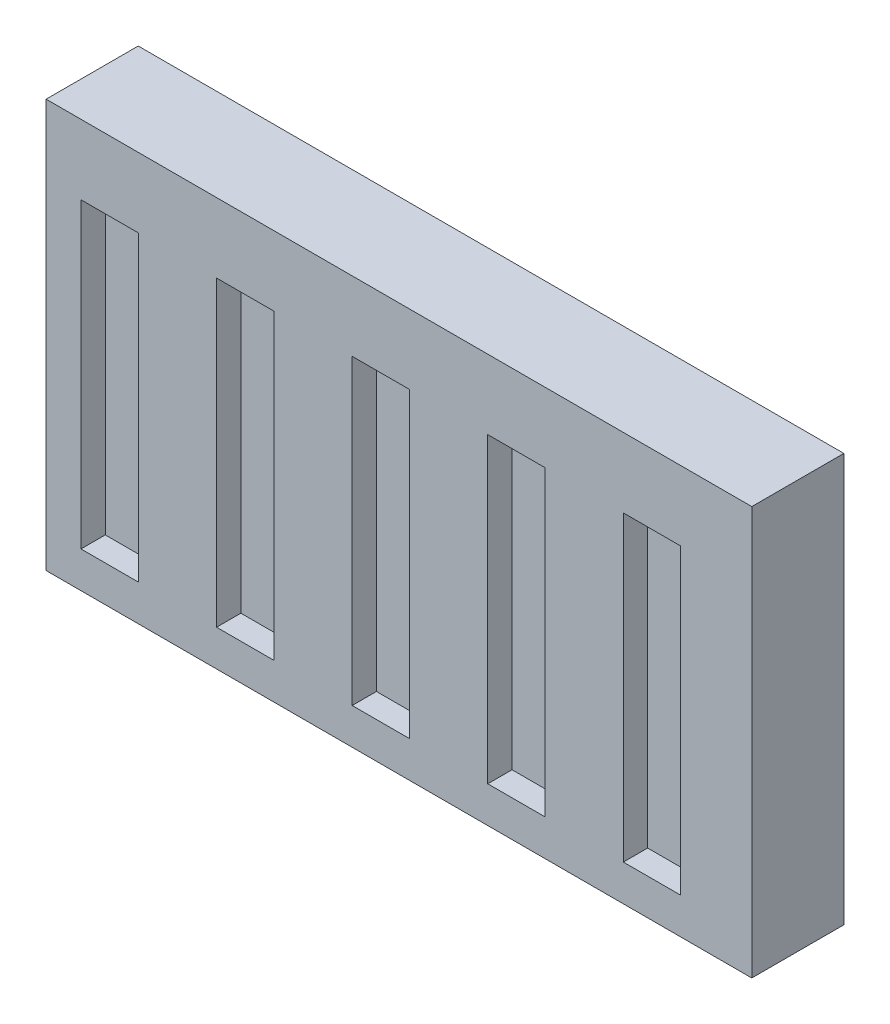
ISO-10303-21;
HEADER;
FILE_DESCRIPTION(('STEP AP214'),'2;1');
FILE_NAME('part.step','',(''),(''),'','','');
FILE_SCHEMA(('AUTOMOTIVE_DESIGN { 1 0 10303 214 1 1 1 1 }'));
ENDSEC;
DATA;
#1=APPLICATION_CONTEXT('core data for automotive mechanical design processes');
#2=APPLICATION_PROTOCOL_DEFINITION('international standard','automotive_design',2000,#1);
#3=PRODUCT_CONTEXT('',#1,'mechanical');
#4=PRODUCT('Part','Part','',(#3));
#5=PRODUCT_RELATED_PRODUCT_CATEGORY('part','',(#4));
#6=PRODUCT_DEFINITION_FORMATION('','',#4);
#7=PRODUCT_DEFINITION_CONTEXT('part definition',#1,'design');
#8=PRODUCT_DEFINITION('design','',#6,#7);
#9=PRODUCT_DEFINITION_SHAPE('','',#8);
#10=(LENGTH_UNIT() NAMED_UNIT(*) SI_UNIT(.MILLI.,.METRE.));
#11=(NAMED_UNIT(*) PLANE_ANGLE_UNIT() SI_UNIT($,.RADIAN.));
#12=(NAMED_UNIT(*) SI_UNIT($,.STERADIAN.) SOLID_ANGLE_UNIT());
#13=UNCERTAINTY_MEASURE_WITH_UNIT(LENGTH_MEASURE(1.E-05),#10,'distance_accuracy_value','');
#14=(GEOMETRIC_REPRESENTATION_CONTEXT(3) GLOBAL_UNCERTAINTY_ASSIGNED_CONTEXT((#13)) GLOBAL_UNIT_ASSIGNED_CONTEXT((#10,
#11,#12)) REPRESENTATION_CONTEXT('',''));
#15=CARTESIAN_POINT('',(0.,0.,0.));
#16=DIRECTION('',(0.,0.,1.));
#17=DIRECTION('',(1.,0.,0.));
#18=AXIS2_PLACEMENT_3D('',#15,#16,#17);
#19=CARTESIAN_POINT('',(0.,0.,16.3));
#20=DIRECTION('',(1.,0.,0.));
#21=DIRECTION('',(0.,0.,-1.));
#22=AXIS2_PLACEMENT_3D('',#19,#20,#21);
#23=PLANE('',#22);
#24=DIRECTION('',(0.,-1.,0.));
#25=VECTOR('',#24,1.);
#26=CARTESIAN_POINT('',(0.,0.,0.));
#27=LINE('',#26,#25);
#28=CARTESIAN_POINT('',(0.,72.2640495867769,0.));
#29=VERTEX_POINT('',#28);
#30=CARTESIAN_POINT('',(0.,0.,0.));
#31=VERTEX_POINT('',#30);
#32=EDGE_CURVE('E257',#29,#31,#27,.T.);
#33=ORIENTED_EDGE('',*,*,#32,.T.);
#34=DIRECTION('',(0.,0.,-1.));
#35=VECTOR('',#34,1.);
#36=CARTESIAN_POINT('',(0.,0.,16.3));
#37=LINE('',#36,#35);
#38=CARTESIAN_POINT('',(0.,0.,16.3));
#39=VERTEX_POINT('',#38);
#40=EDGE_CURVE('E290',#39,#31,#37,.T.);
#41=ORIENTED_EDGE('',*,*,#40,.F.);
#42=DIRECTION('',(0.,-1.,0.));
#43=VECTOR('',#42,1.);
#44=CARTESIAN_POINT('',(0.,0.,16.3));
#45=LINE('',#44,#43);
#46=CARTESIAN_POINT('',(0.,72.2640495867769,16.3));
#47=VERTEX_POINT('',#46);
#48=EDGE_CURVE('E272',#47,#39,#45,.T.);
#49=ORIENTED_EDGE('',*,*,#48,.F.);
#50=DIRECTION('',(0.,0.,-1.));
#51=VECTOR('',#50,1.);
#52=CARTESIAN_POINT('',(0.,72.2640495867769,16.3));
#53=LINE('',#52,#51);
#54=EDGE_CURVE('E281',#47,#29,#53,.T.);
#55=ORIENTED_EDGE('',*,*,#54,.T.);
#56=EDGE_LOOP('',(#33,#41,#49,#55));
#57=FACE_BOUND('',#56,.T.);
#58=ADVANCED_FACE('F28',(#57),#23,.F.);
#59=CARTESIAN_POINT('',(0.,0.,16.3));
#60=DIRECTION('',(0.,1.,0.));
#61=DIRECTION('',(0.,0.,1.));
#62=AXIS2_PLACEMENT_3D('',#59,#60,#61);
#63=PLANE('',#62);
#64=DIRECTION('',(1.,0.,0.));
#65=VECTOR('',#64,1.);
#66=CARTESIAN_POINT('',(0.,0.,0.));
#67=LINE('',#66,#65);
#68=CARTESIAN_POINT('',(124.900826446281,0.,0.));
#69=VERTEX_POINT('',#68);
#70=EDGE_CURVE('E266',#31,#69,#67,.T.);
#71=ORIENTED_EDGE('',*,*,#70,.T.);
#72=DIRECTION('',(0.,0.,-1.));
#73=VECTOR('',#72,1.);
#74=CARTESIAN_POINT('',(124.900826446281,0.,16.3));
#75=LINE('',#74,#73);
#76=CARTESIAN_POINT('',(124.900826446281,0.,16.3));
#77=VERTEX_POINT('',#76);
#78=EDGE_CURVE('E287',#77,#69,#75,.T.);
#79=ORIENTED_EDGE('',*,*,#78,.F.);
#80=DIRECTION('',(1.,0.,0.));
#81=VECTOR('',#80,1.);
#82=CARTESIAN_POINT('',(0.,0.,16.3));
#83=LINE('',#82,#81);
#84=EDGE_CURVE('E275',#39,#77,#83,.T.);
#85=ORIENTED_EDGE('',*,*,#84,.F.);
#86=ORIENTED_EDGE('',*,*,#40,.T.);
#87=EDGE_LOOP('',(#71,#79,#85,#86));
#88=FACE_BOUND('',#87,.T.);
#89=ADVANCED_FACE('F416',(#88),#63,.F.);
#90=CARTESIAN_POINT('',(124.900826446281,0.,16.3));
#91=DIRECTION('',(-1.,0.,0.));
#92=DIRECTION('',(0.,0.,1.));
#93=AXIS2_PLACEMENT_3D('',#90,#91,#92);
#94=PLANE('',#93);
#95=DIRECTION('',(0.,1.,0.));
#96=VECTOR('',#95,1.);
#97=CARTESIAN_POINT('',(124.900826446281,0.,0.));
#98=LINE('',#97,#96);
#99=CARTESIAN_POINT('',(124.900826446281,72.2640495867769,0.));
#100=VERTEX_POINT('',#99);
#101=EDGE_CURVE('E268',#69,#100,#98,.T.);
#102=ORIENTED_EDGE('',*,*,#101,.T.);
#103=DIRECTION('',(0.,0.,-1.));
#104=VECTOR('',#103,1.);
#105=CARTESIAN_POINT('',(124.900826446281,72.2640495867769,16.3));
#106=LINE('',#105,#104);
#107=CARTESIAN_POINT('',(124.900826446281,72.2640495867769,16.3));
#108=VERTEX_POINT('',#107);
#109=EDGE_CURVE('E284',#108,#100,#106,.T.);
#110=ORIENTED_EDGE('',*,*,#109,.F.);
#111=DIRECTION('',(0.,1.,0.));
#112=VECTOR('',#111,1.);
#113=CARTESIAN_POINT('',(124.900826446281,0.,16.3));
#114=LINE('',#113,#112);
#115=EDGE_CURVE('E277',#77,#108,#114,.T.);
#116=ORIENTED_EDGE('',*,*,#115,.F.);
#117=ORIENTED_EDGE('',*,*,#78,.T.);
#118=EDGE_LOOP('',(#102,#110,#116,#117));
#119=FACE_BOUND('',#118,.T.);
#120=ADVANCED_FACE('F411',(#119),#94,.F.);
#121=CARTESIAN_POINT('',(0.,72.2640495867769,16.3));
#122=DIRECTION('',(0.,-1.,0.));
#123=DIRECTION('',(0.,0.,-1.));
#124=AXIS2_PLACEMENT_3D('',#121,#122,#123);
#125=PLANE('',#124);
#126=DIRECTION('',(-1.,0.,0.));
#127=VECTOR('',#126,1.);
#128=CARTESIAN_POINT('',(0.,72.2640495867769,0.));
#129=LINE('',#128,#127);
#130=EDGE_CURVE('E270',#100,#29,#129,.T.);
#131=ORIENTED_EDGE('',*,*,#130,.T.);
#132=ORIENTED_EDGE('',*,*,#54,.F.);
#133=DIRECTION('',(-1.,0.,0.));
#134=VECTOR('',#133,1.);
#135=CARTESIAN_POINT('',(0.,72.2640495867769,16.3));
#136=LINE('',#135,#134);
#137=EDGE_CURVE('E279',#108,#47,#136,.T.);
#138=ORIENTED_EDGE('',*,*,#137,.F.);
#139=ORIENTED_EDGE('',*,*,#109,.T.);
#140=EDGE_LOOP('',(#131,#132,#138,#139));
#141=FACE_BOUND('',#140,.T.);
#142=ADVANCED_FACE('F399',(#141),#125,.F.);
#143=CARTESIAN_POINT('',(0.,72.2640495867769,16.3));
#144=DIRECTION('',(0.,0.,-1.));
#145=DIRECTION('',(-1.,0.,0.));
#146=AXIS2_PLACEMENT_3D('',#143,#144,#145);
#147=PLANE('',#146);
#148=DIRECTION('',(1.,0.,0.));
#149=VECTOR('',#148,1.);
#150=CARTESIAN_POINT('',(30.1669795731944,6.40222008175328,16.3));
#151=LINE('',#150,#149);
#152=CARTESIAN_POINT('',(30.1669795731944,6.40222008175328,16.3));
#153=VERTEX_POINT('',#152);
#154=CARTESIAN_POINT('',(40.3277941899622,6.40222008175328,16.3));
#155=VERTEX_POINT('',#154);
#156=EDGE_CURVE('E202',#153,#155,#151,.T.);
#157=ORIENTED_EDGE('',*,*,#156,.F.);
#158=DIRECTION('',(0.,-1.,0.));
#159=VECTOR('',#158,1.);
#160=CARTESIAN_POINT('',(30.1669795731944,6.40222008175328,16.3));
#161=LINE('',#160,#159);
#162=CARTESIAN_POINT('',(30.1669795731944,59.9292769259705,16.3));
#163=VERTEX_POINT('',#162);
#164=EDGE_CURVE('E216',#163,#153,#161,.T.);
#165=ORIENTED_EDGE('',*,*,#164,.F.);
#166=DIRECTION('',(-1.,0.,0.));
#167=VECTOR('',#166,1.);
#168=CARTESIAN_POINT('',(30.1669795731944,59.9292769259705,16.3));
#169=LINE('',#168,#167);
#170=CARTESIAN_POINT('',(40.3277941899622,59.9292769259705,16.3));
#171=VERTEX_POINT('',#170);
#172=EDGE_CURVE('E226',#171,#163,#169,.T.);
#173=ORIENTED_EDGE('',*,*,#172,.F.);
#174=DIRECTION('',(0.,1.,0.));
#175=VECTOR('',#174,1.);
#176=CARTESIAN_POINT('',(40.3277941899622,6.40222008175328,16.3));
#177=LINE('',#176,#175);
#178=EDGE_CURVE('E217',#155,#171,#177,.T.);
#179=ORIENTED_EDGE('',*,*,#178,.F.);
#180=EDGE_LOOP('',(#157,#165,#173,#179));
#181=FACE_BOUND('',#180,.T.);
#182=DIRECTION('',(1.,0.,0.));
#183=VECTOR('',#182,1.);
#184=CARTESIAN_POINT('',(6.16697957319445,6.40222008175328,16.3));
#185=LINE('',#184,#183);
#186=CARTESIAN_POINT('',(6.16697957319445,6.40222008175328,16.3));
#187=VERTEX_POINT('',#186);
#188=CARTESIAN_POINT('',(16.3277941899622,6.40222008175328,16.3));
#189=VERTEX_POINT('',#188);
#190=EDGE_CURVE('E233',#187,#189,#185,.T.);
#191=ORIENTED_EDGE('',*,*,#190,.F.);
#192=DIRECTION('',(0.,-1.,0.));
#193=VECTOR('',#192,1.);
#194=CARTESIAN_POINT('',(6.16697957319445,6.40222008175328,16.3));
#195=LINE('',#194,#193);
#196=CARTESIAN_POINT('',(6.16697957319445,59.9292769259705,16.3));
#197=VERTEX_POINT('',#196);
#198=EDGE_CURVE('E231',#197,#187,#195,.T.);
#199=ORIENTED_EDGE('',*,*,#198,.F.);
#200=DIRECTION('',(-1.,0.,0.));
#201=VECTOR('',#200,1.);
#202=CARTESIAN_POINT('',(6.16697957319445,59.9292769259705,16.3));
#203=LINE('',#202,#201);
#204=CARTESIAN_POINT('',(16.3277941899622,59.9292769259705,16.3));
#205=VERTEX_POINT('',#204);
#206=EDGE_CURVE('E239',#205,#197,#203,.T.);
#207=ORIENTED_EDGE('',*,*,#206,.F.);
#208=DIRECTION('',(0.,1.,0.));
#209=VECTOR('',#208,1.);
#210=CARTESIAN_POINT('',(16.3277941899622,6.40222008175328,16.3));
#211=LINE('',#210,#209);
#212=EDGE_CURVE('E236',#189,#205,#211,.T.);
#213=ORIENTED_EDGE('',*,*,#212,.F.);
#214=EDGE_LOOP('',(#191,#199,#207,#213));
#215=FACE_BOUND('',#214,.T.);
#216=ORIENTED_EDGE('',*,*,#48,.T.);
#217=ORIENTED_EDGE('',*,*,#84,.T.);
#218=ORIENTED_EDGE('',*,*,#115,.T.);
#219=ORIENTED_EDGE('',*,*,#137,.T.);
#220=EDGE_LOOP('',(#216,#217,#218,#219));
#221=FACE_BOUND('',#220,.T.);
#222=DIRECTION('',(0.,-1.,0.));
#223=VECTOR('',#222,1.);
#224=CARTESIAN_POINT('',(54.1669795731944,6.40222008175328,16.3));
#225=LINE('',#224,#223);
#226=CARTESIAN_POINT('',(54.1669795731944,59.9292769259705,16.3));
#227=VERTEX_POINT('',#226);
#228=CARTESIAN_POINT('',(54.1669795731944,6.40222008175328,16.3));
#229=VERTEX_POINT('',#228);
#230=EDGE_CURVE('E293',#227,#229,#225,.T.);
#231=ORIENTED_EDGE('',*,*,#230,.F.);
#232=DIRECTION('',(-1.,0.,0.));
#233=VECTOR('',#232,1.);
#234=CARTESIAN_POINT('',(54.1669795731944,59.9292769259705,16.3));
#235=LINE('',#234,#233);
#236=CARTESIAN_POINT('',(64.3277941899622,59.9292769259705,16.3));
#237=VERTEX_POINT('',#236);
#238=EDGE_CURVE('E295',#237,#227,#235,.T.);
#239=ORIENTED_EDGE('',*,*,#238,.F.);
#240=DIRECTION('',(0.,1.,0.));
#241=VECTOR('',#240,1.);
#242=CARTESIAN_POINT('',(64.3277941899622,6.40222008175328,16.3));
#243=LINE('',#242,#241);
#244=CARTESIAN_POINT('',(64.3277941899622,6.40222008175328,16.3));
#245=VERTEX_POINT('',#244);
#246=EDGE_CURVE('E298',#245,#237,#243,.T.);
#247=ORIENTED_EDGE('',*,*,#246,.F.);
#248=DIRECTION('',(1.,0.,0.));
#249=VECTOR('',#248,1.);
#250=CARTESIAN_POINT('',(54.1669795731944,6.40222008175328,16.3));
#251=LINE('',#250,#249);
#252=EDGE_CURVE('E301',#229,#245,#251,.T.);
#253=ORIENTED_EDGE('',*,*,#252,.F.);
#254=EDGE_LOOP('',(#231,#239,#247,#253));
#255=FACE_BOUND('',#254,.T.);
#256=DIRECTION('',(0.,-1.,0.));
#257=VECTOR('',#256,1.);
#258=CARTESIAN_POINT('',(78.1669795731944,6.40222008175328,16.3));
#259=LINE('',#258,#257);
#260=CARTESIAN_POINT('',(78.1669795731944,59.9292769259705,16.3));
#261=VERTEX_POINT('',#260);
#262=CARTESIAN_POINT('',(78.1669795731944,6.40222008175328,16.3));
#263=VERTEX_POINT('',#262);
#264=EDGE_CURVE('E328',#261,#263,#259,.T.);
#265=ORIENTED_EDGE('',*,*,#264,.F.);
#266=DIRECTION('',(-1.,0.,0.));
#267=VECTOR('',#266,1.);
#268=CARTESIAN_POINT('',(78.1669795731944,59.9292769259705,16.3));
#269=LINE('',#268,#267);
#270=CARTESIAN_POINT('',(88.3277941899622,59.9292769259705,16.3));
#271=VERTEX_POINT('',#270);
#272=EDGE_CURVE('E330',#271,#261,#269,.T.);
#273=ORIENTED_EDGE('',*,*,#272,.F.);
#274=DIRECTION('',(0.,1.,0.));
#275=VECTOR('',#274,1.);
#276=CARTESIAN_POINT('',(88.3277941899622,6.40222008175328,16.3));
#277=LINE('',#276,#275);
#278=CARTESIAN_POINT('',(88.3277941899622,6.40222008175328,16.3));
#279=VERTEX_POINT('',#278);
#280=EDGE_CURVE('E333',#279,#271,#277,.T.);
#281=ORIENTED_EDGE('',*,*,#280,.F.);
#282=DIRECTION('',(1.,0.,0.));
#283=VECTOR('',#282,1.);
#284=CARTESIAN_POINT('',(78.1669795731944,6.40222008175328,16.3));
#285=LINE('',#284,#283);
#286=EDGE_CURVE('E336',#263,#279,#285,.T.);
#287=ORIENTED_EDGE('',*,*,#286,.F.);
#288=EDGE_LOOP('',(#265,#273,#281,#287));
#289=FACE_BOUND('',#288,.T.);
#290=DIRECTION('',(0.,-1.,0.));
#291=VECTOR('',#290,1.);
#292=CARTESIAN_POINT('',(102.166979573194,6.40222008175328,16.3));
#293=LINE('',#292,#291);
#294=CARTESIAN_POINT('',(102.166979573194,59.9292769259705,16.3));
#295=VERTEX_POINT('',#294);
#296=CARTESIAN_POINT('',(102.166979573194,6.40222008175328,16.3));
#297=VERTEX_POINT('',#296);
#298=EDGE_CURVE('E363',#295,#297,#293,.T.);
#299=ORIENTED_EDGE('',*,*,#298,.F.);
#300=DIRECTION('',(-1.,0.,0.));
#301=VECTOR('',#300,1.);
#302=CARTESIAN_POINT('',(102.166979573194,59.9292769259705,16.3));
#303=LINE('',#302,#301);
#304=CARTESIAN_POINT('',(112.327794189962,59.9292769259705,16.3));
#305=VERTEX_POINT('',#304);
#306=EDGE_CURVE('E365',#305,#295,#303,.T.);
#307=ORIENTED_EDGE('',*,*,#306,.F.);
#308=DIRECTION('',(0.,1.,0.));
#309=VECTOR('',#308,1.);
#310=CARTESIAN_POINT('',(112.327794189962,6.40222008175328,16.3));
#311=LINE('',#310,#309);
#312=CARTESIAN_POINT('',(112.327794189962,6.40222008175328,16.3));
#313=VERTEX_POINT('',#312);
#314=EDGE_CURVE('E368',#313,#305,#311,.T.);
#315=ORIENTED_EDGE('',*,*,#314,.F.);
#316=DIRECTION('',(1.,0.,0.));
#317=VECTOR('',#316,1.);
#318=CARTESIAN_POINT('',(102.166979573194,6.40222008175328,16.3));
#319=LINE('',#318,#317);
#320=EDGE_CURVE('E371',#297,#313,#319,.T.);
#321=ORIENTED_EDGE('',*,*,#320,.F.);
#322=EDGE_LOOP('',(#299,#307,#315,#321));
#323=FACE_BOUND('',#322,.T.);
#324=ADVANCED_FACE('F396',(#181,#215,#221,#255,#289,#323),#147,.F.);
#325=CARTESIAN_POINT('',(0.,72.2640495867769,0.));
#326=DIRECTION('',(0.,0.,-1.));
#327=DIRECTION('',(-1.,0.,0.));
#328=AXIS2_PLACEMENT_3D('',#325,#326,#327);
#329=PLANE('',#328);
#330=ORIENTED_EDGE('',*,*,#32,.F.);
#331=ORIENTED_EDGE('',*,*,#130,.F.);
#332=ORIENTED_EDGE('',*,*,#101,.F.);
#333=ORIENTED_EDGE('',*,*,#70,.F.);
#334=EDGE_LOOP('',(#330,#331,#332,#333));
#335=FACE_BOUND('',#334,.T.);
#336=ADVANCED_FACE('F398',(#335),#329,.T.);
#337=CARTESIAN_POINT('',(6.16697957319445,6.40222008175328,12.));
#338=DIRECTION('',(-1.,0.,0.));
#339=DIRECTION('',(0.,0.,1.));
#340=AXIS2_PLACEMENT_3D('',#337,#338,#339);
#341=PLANE('',#340);
#342=ORIENTED_EDGE('',*,*,#198,.T.);
#343=DIRECTION('',(0.,0.,1.));
#344=VECTOR('',#343,1.);
#345=CARTESIAN_POINT('',(6.16697957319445,6.40222008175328,12.));
#346=LINE('',#345,#344);
#347=CARTESIAN_POINT('',(6.16697957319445,6.40222008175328,12.));
#348=VERTEX_POINT('',#347);
#349=EDGE_CURVE('E254',#348,#187,#346,.T.);
#350=ORIENTED_EDGE('',*,*,#349,.F.);
#351=DIRECTION('',(0.,-1.,0.));
#352=VECTOR('',#351,1.);
#353=CARTESIAN_POINT('',(6.16697957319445,6.40222008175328,12.));
#354=LINE('',#353,#352);
#355=CARTESIAN_POINT('',(6.16697957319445,59.9292769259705,12.));
#356=VERTEX_POINT('',#355);
#357=EDGE_CURVE('E242',#356,#348,#354,.T.);
#358=ORIENTED_EDGE('',*,*,#357,.F.);
#359=DIRECTION('',(0.,0.,1.));
#360=VECTOR('',#359,1.);
#361=CARTESIAN_POINT('',(6.16697957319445,59.9292769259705,12.));
#362=LINE('',#361,#360);
#363=EDGE_CURVE('E255',#356,#197,#362,.T.);
#364=ORIENTED_EDGE('',*,*,#363,.T.);
#365=EDGE_LOOP('',(#342,#350,#358,#364));
#366=FACE_BOUND('',#365,.T.);
#367=ADVANCED_FACE('F407',(#366),#341,.F.);
#368=CARTESIAN_POINT('',(6.16697957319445,59.9292769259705,12.));
#369=DIRECTION('',(0.,1.,0.));
#370=DIRECTION('',(0.,0.,1.));
#371=AXIS2_PLACEMENT_3D('',#368,#369,#370);
#372=PLANE('',#371);
#373=ORIENTED_EDGE('',*,*,#206,.T.);
#374=ORIENTED_EDGE('',*,*,#363,.F.);
#375=DIRECTION('',(-1.,0.,0.));
#376=VECTOR('',#375,1.);
#377=CARTESIAN_POINT('',(6.16697957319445,59.9292769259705,12.));
#378=LINE('',#377,#376);
#379=CARTESIAN_POINT('',(16.3277941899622,59.9292769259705,12.));
#380=VERTEX_POINT('',#379);
#381=EDGE_CURVE('E251',#380,#356,#378,.T.);
#382=ORIENTED_EDGE('',*,*,#381,.F.);
#383=DIRECTION('',(0.,0.,1.));
#384=VECTOR('',#383,1.);
#385=CARTESIAN_POINT('',(16.3277941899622,59.9292769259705,12.));
#386=LINE('',#385,#384);
#387=EDGE_CURVE('E258',#380,#205,#386,.T.);
#388=ORIENTED_EDGE('',*,*,#387,.T.);
#389=EDGE_LOOP('',(#373,#374,#382,#388));
#390=FACE_BOUND('',#389,.T.);
#391=ADVANCED_FACE('F573',(#390),#372,.F.);
#392=CARTESIAN_POINT('',(16.3277941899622,6.40222008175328,12.));
#393=DIRECTION('',(1.,0.,0.));
#394=DIRECTION('',(0.,0.,-1.));
#395=AXIS2_PLACEMENT_3D('',#392,#393,#394);
#396=PLANE('',#395);
#397=ORIENTED_EDGE('',*,*,#212,.T.);
#398=ORIENTED_EDGE('',*,*,#387,.F.);
#399=DIRECTION('',(0.,1.,0.));
#400=VECTOR('',#399,1.);
#401=CARTESIAN_POINT('',(16.3277941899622,6.40222008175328,12.));
#402=LINE('',#401,#400);
#403=CARTESIAN_POINT('',(16.3277941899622,6.40222008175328,12.));
#404=VERTEX_POINT('',#403);
#405=EDGE_CURVE('E248',#404,#380,#402,.T.);
#406=ORIENTED_EDGE('',*,*,#405,.F.);
#407=DIRECTION('',(0.,0.,1.));
#408=VECTOR('',#407,1.);
#409=CARTESIAN_POINT('',(16.3277941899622,6.40222008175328,12.));
#410=LINE('',#409,#408);
#411=EDGE_CURVE('E260',#404,#189,#410,.T.);
#412=ORIENTED_EDGE('',*,*,#411,.T.);
#413=EDGE_LOOP('',(#397,#398,#406,#412));
#414=FACE_BOUND('',#413,.T.);
#415=ADVANCED_FACE('F565',(#414),#396,.F.);
#416=CARTESIAN_POINT('',(6.16697957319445,6.40222008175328,12.));
#417=DIRECTION('',(0.,-1.,0.));
#418=DIRECTION('',(0.,0.,-1.));
#419=AXIS2_PLACEMENT_3D('',#416,#417,#418);
#420=PLANE('',#419);
#421=ORIENTED_EDGE('',*,*,#190,.T.);
#422=ORIENTED_EDGE('',*,*,#411,.F.);
#423=DIRECTION('',(1.,0.,0.));
#424=VECTOR('',#423,1.);
#425=CARTESIAN_POINT('',(6.16697957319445,6.40222008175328,12.));
#426=LINE('',#425,#424);
#427=EDGE_CURVE('E245',#348,#404,#426,.T.);
#428=ORIENTED_EDGE('',*,*,#427,.F.);
#429=ORIENTED_EDGE('',*,*,#349,.T.);
#430=EDGE_LOOP('',(#421,#422,#428,#429));
#431=FACE_BOUND('',#430,.T.);
#432=ADVANCED_FACE('F557',(#431),#420,.F.);
#433=CARTESIAN_POINT('',(6.16697957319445,59.9292769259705,12.));
#434=DIRECTION('',(0.,0.,-1.));
#435=DIRECTION('',(-1.,0.,0.));
#436=AXIS2_PLACEMENT_3D('',#433,#434,#435);
#437=PLANE('',#436);
#438=ORIENTED_EDGE('',*,*,#357,.T.);
#439=ORIENTED_EDGE('',*,*,#427,.T.);
#440=ORIENTED_EDGE('',*,*,#405,.T.);
#441=ORIENTED_EDGE('',*,*,#381,.T.);
#442=EDGE_LOOP('',(#438,#439,#440,#441));
#443=FACE_BOUND('',#442,.T.);
#444=ADVANCED_FACE('F524',(#443),#437,.F.);
#445=CARTESIAN_POINT('',(30.1669795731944,6.40222008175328,12.));
#446=DIRECTION('',(-1.,0.,0.));
#447=DIRECTION('',(0.,0.,1.));
#448=AXIS2_PLACEMENT_3D('',#445,#446,#447);
#449=PLANE('',#448);
#450=ORIENTED_EDGE('',*,*,#164,.T.);
#451=DIRECTION('',(0.,0.,1.));
#452=VECTOR('',#451,1.);
#453=CARTESIAN_POINT('',(30.1669795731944,6.40222008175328,12.));
#454=LINE('',#453,#452);
#455=CARTESIAN_POINT('',(30.1669795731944,6.40222008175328,12.));
#456=VERTEX_POINT('',#455);
#457=EDGE_CURVE('E208',#456,#153,#454,.T.);
#458=ORIENTED_EDGE('',*,*,#457,.F.);
#459=DIRECTION('',(0.,-1.,0.));
#460=VECTOR('',#459,1.);
#461=CARTESIAN_POINT('',(30.1669795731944,6.40222008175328,12.));
#462=LINE('',#461,#460);
#463=CARTESIAN_POINT('',(30.1669795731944,59.9292769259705,12.));
#464=VERTEX_POINT('',#463);
#465=EDGE_CURVE('E191',#464,#456,#462,.T.);
#466=ORIENTED_EDGE('',*,*,#465,.F.);
#467=DIRECTION('',(0.,0.,1.));
#468=VECTOR('',#467,1.);
#469=CARTESIAN_POINT('',(30.1669795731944,59.9292769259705,12.));
#470=LINE('',#469,#468);
#471=EDGE_CURVE('E228',#464,#163,#470,.T.);
#472=ORIENTED_EDGE('',*,*,#471,.T.);
#473=EDGE_LOOP('',(#450,#458,#466,#472));
#474=FACE_BOUND('',#473,.T.);
#475=ADVANCED_FACE('F214',(#474),#449,.F.);
#476=CARTESIAN_POINT('',(30.1669795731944,59.9292769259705,12.));
#477=DIRECTION('',(0.,1.,0.));
#478=DIRECTION('',(0.,0.,1.));
#479=AXIS2_PLACEMENT_3D('',#476,#477,#478);
#480=PLANE('',#479);
#481=ORIENTED_EDGE('',*,*,#172,.T.);
#482=ORIENTED_EDGE('',*,*,#471,.F.);
#483=DIRECTION('',(-1.,0.,0.));
#484=VECTOR('',#483,1.);
#485=CARTESIAN_POINT('',(30.1669795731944,59.9292769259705,12.));
#486=LINE('',#485,#484);
#487=CARTESIAN_POINT('',(40.3277941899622,59.9292769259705,12.));
#488=VERTEX_POINT('',#487);
#489=EDGE_CURVE('E197',#488,#464,#486,.T.);
#490=ORIENTED_EDGE('',*,*,#489,.F.);
#491=DIRECTION('',(0.,0.,1.));
#492=VECTOR('',#491,1.);
#493=CARTESIAN_POINT('',(40.3277941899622,59.9292769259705,12.));
#494=LINE('',#493,#492);
#495=EDGE_CURVE('E219',#488,#171,#494,.T.);
#496=ORIENTED_EDGE('',*,*,#495,.T.);
#497=EDGE_LOOP('',(#481,#482,#490,#496));
#498=FACE_BOUND('',#497,.T.);
#499=ADVANCED_FACE('F537',(#498),#480,.F.);
#500=CARTESIAN_POINT('',(40.3277941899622,6.40222008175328,12.));
#501=DIRECTION('',(1.,0.,0.));
#502=DIRECTION('',(0.,0.,-1.));
#503=AXIS2_PLACEMENT_3D('',#500,#501,#502);
#504=PLANE('',#503);
#505=ORIENTED_EDGE('',*,*,#178,.T.);
#506=ORIENTED_EDGE('',*,*,#495,.F.);
#507=DIRECTION('',(0.,1.,0.));
#508=VECTOR('',#507,1.);
#509=CARTESIAN_POINT('',(40.3277941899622,6.40222008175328,12.));
#510=LINE('',#509,#508);
#511=CARTESIAN_POINT('',(40.3277941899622,6.40222008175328,12.));
#512=VERTEX_POINT('',#511);
#513=EDGE_CURVE('E212',#512,#488,#510,.T.);
#514=ORIENTED_EDGE('',*,*,#513,.F.);
#515=DIRECTION('',(0.,0.,1.));
#516=VECTOR('',#515,1.);
#517=CARTESIAN_POINT('',(40.3277941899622,6.40222008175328,12.));
#518=LINE('',#517,#516);
#519=EDGE_CURVE('E211',#512,#155,#518,.T.);
#520=ORIENTED_EDGE('',*,*,#519,.T.);
#521=EDGE_LOOP('',(#505,#506,#514,#520));
#522=FACE_BOUND('',#521,.T.);
#523=ADVANCED_FACE('F530',(#522),#504,.F.);
#524=CARTESIAN_POINT('',(30.1669795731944,6.40222008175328,12.));
#525=DIRECTION('',(0.,-1.,0.));
#526=DIRECTION('',(0.,0.,-1.));
#527=AXIS2_PLACEMENT_3D('',#524,#525,#526);
#528=PLANE('',#527);
#529=ORIENTED_EDGE('',*,*,#156,.T.);
#530=ORIENTED_EDGE('',*,*,#519,.F.);
#531=DIRECTION('',(1.,0.,0.));
#532=VECTOR('',#531,1.);
#533=CARTESIAN_POINT('',(30.1669795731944,6.40222008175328,12.));
#534=LINE('',#533,#532);
#535=EDGE_CURVE('E194',#456,#512,#534,.T.);
#536=ORIENTED_EDGE('',*,*,#535,.F.);
#537=ORIENTED_EDGE('',*,*,#457,.T.);
#538=EDGE_LOOP('',(#529,#530,#536,#537));
#539=FACE_BOUND('',#538,.T.);
#540=ADVANCED_FACE('F207',(#539),#528,.F.);
#541=CARTESIAN_POINT('',(30.1669795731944,59.9292769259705,12.));
#542=DIRECTION('',(0.,0.,-1.));
#543=DIRECTION('',(-1.,0.,0.));
#544=AXIS2_PLACEMENT_3D('',#541,#542,#543);
#545=PLANE('',#544);
#546=ORIENTED_EDGE('',*,*,#465,.T.);
#547=ORIENTED_EDGE('',*,*,#535,.T.);
#548=ORIENTED_EDGE('',*,*,#513,.T.);
#549=ORIENTED_EDGE('',*,*,#489,.T.);
#550=EDGE_LOOP('',(#546,#547,#548,#549));
#551=FACE_BOUND('',#550,.T.);
#552=ADVANCED_FACE('F193',(#551),#545,.F.);
#553=CARTESIAN_POINT('',(54.1669795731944,59.9292769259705,12.));
#554=DIRECTION('',(0.,0.,-1.));
#555=DIRECTION('',(-1.,0.,0.));
#556=AXIS2_PLACEMENT_3D('',#553,#554,#555);
#557=PLANE('',#556);
#558=DIRECTION('',(0.,-1.,0.));
#559=VECTOR('',#558,1.);
#560=CARTESIAN_POINT('',(54.1669795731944,6.40222008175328,12.));
#561=LINE('',#560,#559);
#562=CARTESIAN_POINT('',(54.1669795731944,59.9292769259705,12.));
#563=VERTEX_POINT('',#562);
#564=CARTESIAN_POINT('',(54.1669795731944,6.40222008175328,12.));
#565=VERTEX_POINT('',#564);
#566=EDGE_CURVE('E307',#563,#565,#561,.T.);
#567=ORIENTED_EDGE('',*,*,#566,.T.);
#568=DIRECTION('',(1.,0.,0.));
#569=VECTOR('',#568,1.);
#570=CARTESIAN_POINT('',(54.1669795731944,6.40222008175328,12.));
#571=LINE('',#570,#569);
#572=CARTESIAN_POINT('',(64.3277941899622,6.40222008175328,12.));
#573=VERTEX_POINT('',#572);
#574=EDGE_CURVE('E325',#565,#573,#571,.T.);
#575=ORIENTED_EDGE('',*,*,#574,.T.);
#576=DIRECTION('',(0.,1.,0.));
#577=VECTOR('',#576,1.);
#578=CARTESIAN_POINT('',(64.3277941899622,6.40222008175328,12.));
#579=LINE('',#578,#577);
#580=CARTESIAN_POINT('',(64.3277941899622,59.9292769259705,12.));
#581=VERTEX_POINT('',#580);
#582=EDGE_CURVE('E319',#573,#581,#579,.T.);
#583=ORIENTED_EDGE('',*,*,#582,.T.);
#584=DIRECTION('',(-1.,0.,0.));
#585=VECTOR('',#584,1.);
#586=CARTESIAN_POINT('',(54.1669795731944,59.9292769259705,12.));
#587=LINE('',#586,#585);
#588=EDGE_CURVE('E313',#581,#563,#587,.T.);
#589=ORIENTED_EDGE('',*,*,#588,.T.);
#590=EDGE_LOOP('',(#567,#575,#583,#589));
#591=FACE_BOUND('',#590,.T.);
#592=ADVANCED_FACE('F442',(#591),#557,.F.);
#593=CARTESIAN_POINT('',(54.1669795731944,6.40222008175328,12.));
#594=DIRECTION('',(0.,-1.,0.));
#595=DIRECTION('',(0.,0.,-1.));
#596=AXIS2_PLACEMENT_3D('',#593,#594,#595);
#597=PLANE('',#596);
#598=ORIENTED_EDGE('',*,*,#252,.T.);
#599=DIRECTION('',(0.,0.,1.));
#600=VECTOR('',#599,1.);
#601=CARTESIAN_POINT('',(64.3277941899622,6.40222008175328,12.));
#602=LINE('',#601,#600);
#603=EDGE_CURVE('E322',#573,#245,#602,.T.);
#604=ORIENTED_EDGE('',*,*,#603,.F.);
#605=ORIENTED_EDGE('',*,*,#574,.F.);
#606=DIRECTION('',(0.,0.,1.));
#607=VECTOR('',#606,1.);
#608=CARTESIAN_POINT('',(54.1669795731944,6.40222008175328,12.));
#609=LINE('',#608,#607);
#610=EDGE_CURVE('E304',#565,#229,#609,.T.);
#611=ORIENTED_EDGE('',*,*,#610,.T.);
#612=EDGE_LOOP('',(#598,#604,#605,#611));
#613=FACE_BOUND('',#612,.T.);
#614=ADVANCED_FACE('F438',(#613),#597,.F.);
#615=CARTESIAN_POINT('',(64.3277941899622,6.40222008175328,12.));
#616=DIRECTION('',(1.,0.,0.));
#617=DIRECTION('',(0.,0.,-1.));
#618=AXIS2_PLACEMENT_3D('',#615,#616,#617);
#619=PLANE('',#618);
#620=ORIENTED_EDGE('',*,*,#246,.T.);
#621=DIRECTION('',(0.,0.,1.));
#622=VECTOR('',#621,1.);
#623=CARTESIAN_POINT('',(64.3277941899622,59.9292769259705,12.));
#624=LINE('',#623,#622);
#625=EDGE_CURVE('E316',#581,#237,#624,.T.);
#626=ORIENTED_EDGE('',*,*,#625,.F.);
#627=ORIENTED_EDGE('',*,*,#582,.F.);
#628=ORIENTED_EDGE('',*,*,#603,.T.);
#629=EDGE_LOOP('',(#620,#626,#627,#628));
#630=FACE_BOUND('',#629,.T.);
#631=ADVANCED_FACE('F434',(#630),#619,.F.);
#632=CARTESIAN_POINT('',(54.1669795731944,59.9292769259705,12.));
#633=DIRECTION('',(0.,1.,0.));
#634=DIRECTION('',(0.,0.,1.));
#635=AXIS2_PLACEMENT_3D('',#632,#633,#634);
#636=PLANE('',#635);
#637=ORIENTED_EDGE('',*,*,#238,.T.);
#638=DIRECTION('',(0.,0.,1.));
#639=VECTOR('',#638,1.);
#640=CARTESIAN_POINT('',(54.1669795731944,59.9292769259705,12.));
#641=LINE('',#640,#639);
#642=EDGE_CURVE('E310',#563,#227,#641,.T.);
#643=ORIENTED_EDGE('',*,*,#642,.F.);
#644=ORIENTED_EDGE('',*,*,#588,.F.);
#645=ORIENTED_EDGE('',*,*,#625,.T.);
#646=EDGE_LOOP('',(#637,#643,#644,#645));
#647=FACE_BOUND('',#646,.T.);
#648=ADVANCED_FACE('F430',(#647),#636,.F.);
#649=CARTESIAN_POINT('',(54.1669795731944,6.40222008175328,12.));
#650=DIRECTION('',(-1.,0.,0.));
#651=DIRECTION('',(0.,0.,1.));
#652=AXIS2_PLACEMENT_3D('',#649,#650,#651);
#653=PLANE('',#652);
#654=ORIENTED_EDGE('',*,*,#230,.T.);
#655=ORIENTED_EDGE('',*,*,#610,.F.);
#656=ORIENTED_EDGE('',*,*,#566,.F.);
#657=ORIENTED_EDGE('',*,*,#642,.T.);
#658=EDGE_LOOP('',(#654,#655,#656,#657));
#659=FACE_BOUND('',#658,.T.);
#660=ADVANCED_FACE('F426',(#659),#653,.F.);
#661=CARTESIAN_POINT('',(78.1669795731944,59.9292769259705,12.));
#662=DIRECTION('',(0.,0.,-1.));
#663=DIRECTION('',(-1.,0.,0.));
#664=AXIS2_PLACEMENT_3D('',#661,#662,#663);
#665=PLANE('',#664);
#666=DIRECTION('',(0.,-1.,0.));
#667=VECTOR('',#666,1.);
#668=CARTESIAN_POINT('',(78.1669795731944,6.40222008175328,12.));
#669=LINE('',#668,#667);
#670=CARTESIAN_POINT('',(78.1669795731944,59.9292769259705,12.));
#671=VERTEX_POINT('',#670);
#672=CARTESIAN_POINT('',(78.1669795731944,6.40222008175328,12.));
#673=VERTEX_POINT('',#672);
#674=EDGE_CURVE('E342',#671,#673,#669,.T.);
#675=ORIENTED_EDGE('',*,*,#674,.T.);
#676=DIRECTION('',(1.,0.,0.));
#677=VECTOR('',#676,1.);
#678=CARTESIAN_POINT('',(78.1669795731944,6.40222008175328,12.));
#679=LINE('',#678,#677);
#680=CARTESIAN_POINT('',(88.3277941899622,6.40222008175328,12.));
#681=VERTEX_POINT('',#680);
#682=EDGE_CURVE('E360',#673,#681,#679,.T.);
#683=ORIENTED_EDGE('',*,*,#682,.T.);
#684=DIRECTION('',(0.,1.,0.));
#685=VECTOR('',#684,1.);
#686=CARTESIAN_POINT('',(88.3277941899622,6.40222008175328,12.));
#687=LINE('',#686,#685);
#688=CARTESIAN_POINT('',(88.3277941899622,59.9292769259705,12.));
#689=VERTEX_POINT('',#688);
#690=EDGE_CURVE('E354',#681,#689,#687,.T.);
#691=ORIENTED_EDGE('',*,*,#690,.T.);
#692=DIRECTION('',(-1.,0.,0.));
#693=VECTOR('',#692,1.);
#694=CARTESIAN_POINT('',(78.1669795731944,59.9292769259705,12.));
#695=LINE('',#694,#693);
#696=EDGE_CURVE('E348',#689,#671,#695,.T.);
#697=ORIENTED_EDGE('',*,*,#696,.T.);
#698=EDGE_LOOP('',(#675,#683,#691,#697));
#699=FACE_BOUND('',#698,.T.);
#700=ADVANCED_FACE('F429',(#699),#665,.F.);
#701=CARTESIAN_POINT('',(78.1669795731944,6.40222008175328,12.));
#702=DIRECTION('',(0.,-1.,0.));
#703=DIRECTION('',(0.,0.,-1.));
#704=AXIS2_PLACEMENT_3D('',#701,#702,#703);
#705=PLANE('',#704);
#706=ORIENTED_EDGE('',*,*,#286,.T.);
#707=DIRECTION('',(0.,0.,1.));
#708=VECTOR('',#707,1.);
#709=CARTESIAN_POINT('',(88.3277941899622,6.40222008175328,12.));
#710=LINE('',#709,#708);
#711=EDGE_CURVE('E357',#681,#279,#710,.T.);
#712=ORIENTED_EDGE('',*,*,#711,.F.);
#713=ORIENTED_EDGE('',*,*,#682,.F.);
#714=DIRECTION('',(0.,0.,1.));
#715=VECTOR('',#714,1.);
#716=CARTESIAN_POINT('',(78.1669795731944,6.40222008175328,12.));
#717=LINE('',#716,#715);
#718=EDGE_CURVE('E339',#673,#263,#717,.T.);
#719=ORIENTED_EDGE('',*,*,#718,.T.);
#720=EDGE_LOOP('',(#706,#712,#713,#719));
#721=FACE_BOUND('',#720,.T.);
#722=ADVANCED_FACE('F458',(#721),#705,.F.);
#723=CARTESIAN_POINT('',(88.3277941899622,6.40222008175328,12.));
#724=DIRECTION('',(1.,0.,0.));
#725=DIRECTION('',(0.,0.,-1.));
#726=AXIS2_PLACEMENT_3D('',#723,#724,#725);
#727=PLANE('',#726);
#728=ORIENTED_EDGE('',*,*,#280,.T.);
#729=DIRECTION('',(0.,0.,1.));
#730=VECTOR('',#729,1.);
#731=CARTESIAN_POINT('',(88.3277941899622,59.9292769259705,12.));
#732=LINE('',#731,#730);
#733=EDGE_CURVE('E351',#689,#271,#732,.T.);
#734=ORIENTED_EDGE('',*,*,#733,.F.);
#735=ORIENTED_EDGE('',*,*,#690,.F.);
#736=ORIENTED_EDGE('',*,*,#711,.T.);
#737=EDGE_LOOP('',(#728,#734,#735,#736));
#738=FACE_BOUND('',#737,.T.);
#739=ADVANCED_FACE('F454',(#738),#727,.F.);
#740=CARTESIAN_POINT('',(78.1669795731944,59.9292769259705,12.));
#741=DIRECTION('',(0.,1.,0.));
#742=DIRECTION('',(0.,0.,1.));
#743=AXIS2_PLACEMENT_3D('',#740,#741,#742);
#744=PLANE('',#743);
#745=ORIENTED_EDGE('',*,*,#272,.T.);
#746=DIRECTION('',(0.,0.,1.));
#747=VECTOR('',#746,1.);
#748=CARTESIAN_POINT('',(78.1669795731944,59.9292769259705,12.));
#749=LINE('',#748,#747);
#750=EDGE_CURVE('E345',#671,#261,#749,.T.);
#751=ORIENTED_EDGE('',*,*,#750,.F.);
#752=ORIENTED_EDGE('',*,*,#696,.F.);
#753=ORIENTED_EDGE('',*,*,#733,.T.);
#754=EDGE_LOOP('',(#745,#751,#752,#753));
#755=FACE_BOUND('',#754,.T.);
#756=ADVANCED_FACE('F450',(#755),#744,.F.);
#757=CARTESIAN_POINT('',(78.1669795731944,6.40222008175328,12.));
#758=DIRECTION('',(-1.,0.,0.));
#759=DIRECTION('',(0.,0.,1.));
#760=AXIS2_PLACEMENT_3D('',#757,#758,#759);
#761=PLANE('',#760);
#762=ORIENTED_EDGE('',*,*,#264,.T.);
#763=ORIENTED_EDGE('',*,*,#718,.F.);
#764=ORIENTED_EDGE('',*,*,#674,.F.);
#765=ORIENTED_EDGE('',*,*,#750,.T.);
#766=EDGE_LOOP('',(#762,#763,#764,#765));
#767=FACE_BOUND('',#766,.T.);
#768=ADVANCED_FACE('F447',(#767),#761,.F.);
#769=CARTESIAN_POINT('',(102.166979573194,59.9292769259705,12.));
#770=DIRECTION('',(0.,0.,-1.));
#771=DIRECTION('',(-1.,0.,0.));
#772=AXIS2_PLACEMENT_3D('',#769,#770,#771);
#773=PLANE('',#772);
#774=DIRECTION('',(0.,-1.,0.));
#775=VECTOR('',#774,1.);
#776=CARTESIAN_POINT('',(102.166979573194,6.40222008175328,12.));
#777=LINE('',#776,#775);
#778=CARTESIAN_POINT('',(102.166979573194,59.9292769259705,12.));
#779=VERTEX_POINT('',#778);
#780=CARTESIAN_POINT('',(102.166979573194,6.40222008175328,12.));
#781=VERTEX_POINT('',#780);
#782=EDGE_CURVE('E377',#779,#781,#777,.T.);
#783=ORIENTED_EDGE('',*,*,#782,.T.);
#784=DIRECTION('',(1.,0.,0.));
#785=VECTOR('',#784,1.);
#786=CARTESIAN_POINT('',(102.166979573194,6.40222008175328,12.));
#787=LINE('',#786,#785);
#788=CARTESIAN_POINT('',(112.327794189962,6.40222008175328,12.));
#789=VERTEX_POINT('',#788);
#790=EDGE_CURVE('E11',#781,#789,#787,.T.);
#791=ORIENTED_EDGE('',*,*,#790,.T.);
#792=DIRECTION('',(0.,1.,0.));
#793=VECTOR('',#792,1.);
#794=CARTESIAN_POINT('',(112.327794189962,6.40222008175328,12.));
#795=LINE('',#794,#793);
#796=CARTESIAN_POINT('',(112.327794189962,59.9292769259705,12.));
#797=VERTEX_POINT('',#796);
#798=EDGE_CURVE('E43',#789,#797,#795,.T.);
#799=ORIENTED_EDGE('',*,*,#798,.T.);
#800=DIRECTION('',(-1.,0.,0.));
#801=VECTOR('',#800,1.);
#802=CARTESIAN_POINT('',(102.166979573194,59.9292769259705,12.));
#803=LINE('',#802,#801);
#804=EDGE_CURVE('E51',#797,#779,#803,.T.);
#805=ORIENTED_EDGE('',*,*,#804,.T.);
#806=EDGE_LOOP('',(#783,#791,#799,#805));
#807=FACE_BOUND('',#806,.T.);
#808=ADVANCED_FACE('F30',(#807),#773,.F.);
#809=CARTESIAN_POINT('',(102.166979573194,6.40222008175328,12.));
#810=DIRECTION('',(0.,-1.,0.));
#811=DIRECTION('',(0.,0.,-1.));
#812=AXIS2_PLACEMENT_3D('',#809,#810,#811);
#813=PLANE('',#812);
#814=ORIENTED_EDGE('',*,*,#320,.T.);
#815=DIRECTION('',(0.,0.,1.));
#816=VECTOR('',#815,1.);
#817=CARTESIAN_POINT('',(112.327794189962,6.40222008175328,12.));
#818=LINE('',#817,#816);
#819=EDGE_CURVE('E36',#789,#313,#818,.T.);
#820=ORIENTED_EDGE('',*,*,#819,.F.);
#821=ORIENTED_EDGE('',*,*,#790,.F.);
#822=DIRECTION('',(0.,0.,1.));
#823=VECTOR('',#822,1.);
#824=CARTESIAN_POINT('',(102.166979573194,6.40222008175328,12.));
#825=LINE('',#824,#823);
#826=EDGE_CURVE('E374',#781,#297,#825,.T.);
#827=ORIENTED_EDGE('',*,*,#826,.T.);
#828=EDGE_LOOP('',(#814,#820,#821,#827));
#829=FACE_BOUND('',#828,.T.);
#830=ADVANCED_FACE('F389',(#829),#813,.F.);
#831=CARTESIAN_POINT('',(112.327794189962,6.40222008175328,12.));
#832=DIRECTION('',(1.,0.,0.));
#833=DIRECTION('',(0.,0.,-1.));
#834=AXIS2_PLACEMENT_3D('',#831,#832,#833);
#835=PLANE('',#834);
#836=ORIENTED_EDGE('',*,*,#314,.T.);
#837=DIRECTION('',(0.,0.,1.));
#838=VECTOR('',#837,1.);
#839=CARTESIAN_POINT('',(112.327794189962,59.9292769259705,12.));
#840=LINE('',#839,#838);
#841=EDGE_CURVE('E384',#797,#305,#840,.T.);
#842=ORIENTED_EDGE('',*,*,#841,.F.);
#843=ORIENTED_EDGE('',*,*,#798,.F.);
#844=ORIENTED_EDGE('',*,*,#819,.T.);
#845=EDGE_LOOP('',(#836,#842,#843,#844));
#846=FACE_BOUND('',#845,.T.);
#847=ADVANCED_FACE('F386',(#846),#835,.F.);
#848=CARTESIAN_POINT('',(102.166979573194,59.9292769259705,12.));
#849=DIRECTION('',(0.,1.,0.));
#850=DIRECTION('',(0.,0.,1.));
#851=AXIS2_PLACEMENT_3D('',#848,#849,#850);
#852=PLANE('',#851);
#853=ORIENTED_EDGE('',*,*,#306,.T.);
#854=DIRECTION('',(0.,0.,1.));
#855=VECTOR('',#854,1.);
#856=CARTESIAN_POINT('',(102.166979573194,59.9292769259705,12.));
#857=LINE('',#856,#855);
#858=EDGE_CURVE('E380',#779,#295,#857,.T.);
#859=ORIENTED_EDGE('',*,*,#858,.F.);
#860=ORIENTED_EDGE('',*,*,#804,.F.);
#861=ORIENTED_EDGE('',*,*,#841,.T.);
#862=EDGE_LOOP('',(#853,#859,#860,#861));
#863=FACE_BOUND('',#862,.T.);
#864=ADVANCED_FACE('F394',(#863),#852,.F.);
#865=CARTESIAN_POINT('',(102.166979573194,6.40222008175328,12.));
#866=DIRECTION('',(-1.,0.,0.));
#867=DIRECTION('',(0.,0.,1.));
#868=AXIS2_PLACEMENT_3D('',#865,#866,#867);
#869=PLANE('',#868);
#870=ORIENTED_EDGE('',*,*,#298,.T.);
#871=ORIENTED_EDGE('',*,*,#826,.F.);
#872=ORIENTED_EDGE('',*,*,#782,.F.);
#873=ORIENTED_EDGE('',*,*,#858,.T.);
#874=EDGE_LOOP('',(#870,#871,#872,#873));
#875=FACE_BOUND('',#874,.T.);
#876=ADVANCED_FACE('F393',(#875),#869,.F.);
#877=CLOSED_SHELL('',(#58,#89,#120,#142,#324,#336,#367,#391,#415,#432,#444,#475,#499,#523,#540,
#552,#592,#614,#631,#648,#660,#700,#722,#739,#756,#768,#808,#830,#847,#864,#876));
#878=MANIFOLD_SOLID_BREP('B2',#877);
#879=ADVANCED_BREP_SHAPE_REPRESENTATION('',(#18,#878),#14);
#880=SHAPE_DEFINITION_REPRESENTATION(#9,#879);
ENDSEC;
END-ISO-10303-21;
